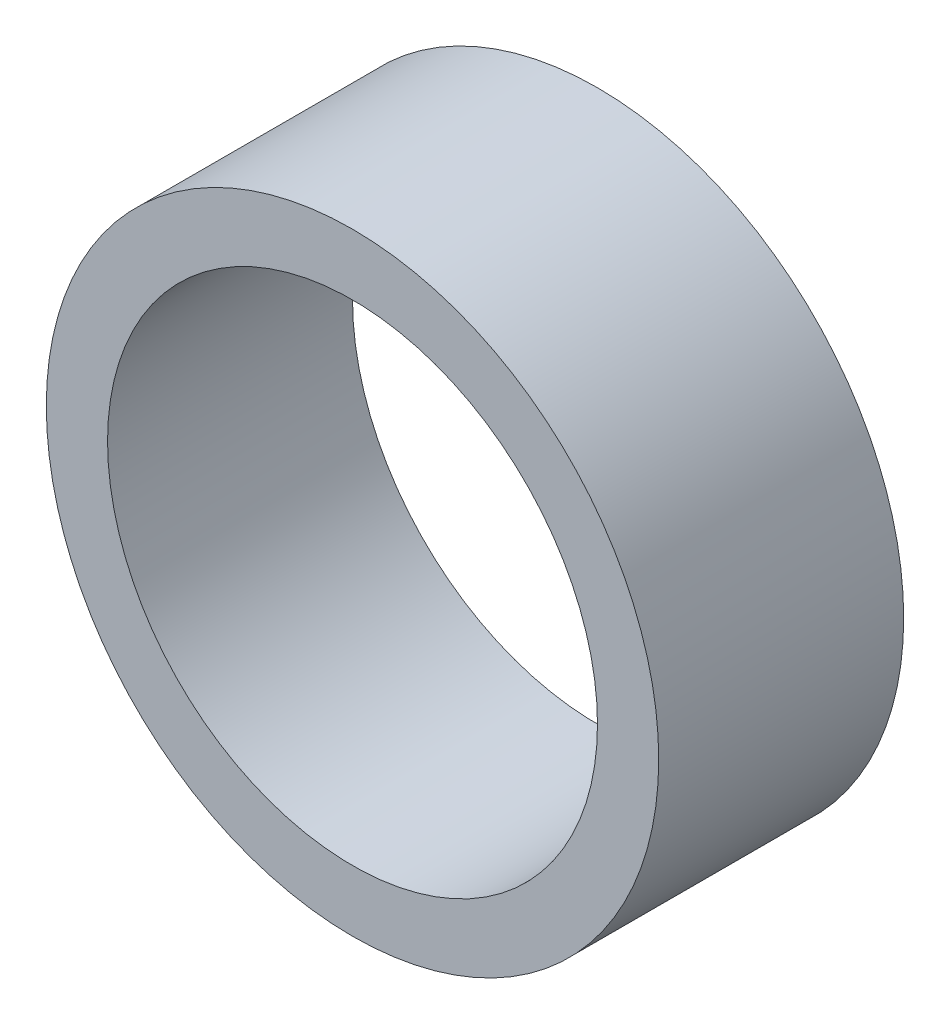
ISO-10303-21;
HEADER;
FILE_DESCRIPTION(('STEP AP214'),'2;1');
FILE_NAME('part.step','',(''),(''),'','','');
FILE_SCHEMA(('AUTOMOTIVE_DESIGN { 1 0 10303 214 1 1 1 1 }'));
ENDSEC;
DATA;
#1=APPLICATION_CONTEXT('core data for automotive mechanical design processes');
#2=APPLICATION_PROTOCOL_DEFINITION('international standard','automotive_design',2000,#1);
#3=PRODUCT_CONTEXT('',#1,'mechanical');
#4=PRODUCT('Part','Part','',(#3));
#5=PRODUCT_RELATED_PRODUCT_CATEGORY('part','',(#4));
#6=PRODUCT_DEFINITION_FORMATION('','',#4);
#7=PRODUCT_DEFINITION_CONTEXT('part definition',#1,'design');
#8=PRODUCT_DEFINITION('design','',#6,#7);
#9=PRODUCT_DEFINITION_SHAPE('','',#8);
#10=(LENGTH_UNIT() NAMED_UNIT(*) SI_UNIT(.MILLI.,.METRE.));
#11=(NAMED_UNIT(*) PLANE_ANGLE_UNIT() SI_UNIT($,.RADIAN.));
#12=(NAMED_UNIT(*) SI_UNIT($,.STERADIAN.) SOLID_ANGLE_UNIT());
#13=UNCERTAINTY_MEASURE_WITH_UNIT(LENGTH_MEASURE(1.E-05),#10,'distance_accuracy_value','');
#14=(GEOMETRIC_REPRESENTATION_CONTEXT(3) GLOBAL_UNCERTAINTY_ASSIGNED_CONTEXT((#13)) GLOBAL_UNIT_ASSIGNED_CONTEXT((#10,
#11,#12)) REPRESENTATION_CONTEXT('',''));
#15=CARTESIAN_POINT('',(0.,0.,0.));
#16=DIRECTION('',(0.,0.,1.));
#17=DIRECTION('',(1.,0.,0.));
#18=AXIS2_PLACEMENT_3D('',#15,#16,#17);
#19=CARTESIAN_POINT('',(0.,0.,-38.9763628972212));
#20=DIRECTION('',(0.,0.,-1.));
#21=DIRECTION('',(-1.,0.,0.));
#22=AXIS2_PLACEMENT_3D('',#19,#20,#21);
#23=CYLINDRICAL_SURFACE('',#22,6.35);
#24=CARTESIAN_POINT('',(0.,0.,6.35));
#25=DIRECTION('',(0.,0.,-1.));
#26=DIRECTION('',(-1.,0.,0.));
#27=AXIS2_PLACEMENT_3D('',#24,#25,#26);
#28=CIRCLE('',#27,6.35);
#29=CARTESIAN_POINT('',(-6.35,0.,6.35));
#30=VERTEX_POINT('',#29);
#31=EDGE_CURVE('E10',#30,#30,#28,.T.);
#32=ORIENTED_EDGE('',*,*,#31,.F.);
#33=EDGE_LOOP('',(#32));
#34=FACE_BOUND('',#33,.T.);
#35=CARTESIAN_POINT('',(0.,0.,0.));
#36=DIRECTION('',(0.,0.,-1.));
#37=DIRECTION('',(-1.,0.,0.));
#38=AXIS2_PLACEMENT_3D('',#35,#36,#37);
#39=CIRCLE('',#38,6.35);
#40=CARTESIAN_POINT('',(-6.35,0.,0.));
#41=VERTEX_POINT('',#40);
#42=EDGE_CURVE('E58',#41,#41,#39,.T.);
#43=ORIENTED_EDGE('',*,*,#42,.T.);
#44=EDGE_LOOP('',(#43));
#45=FACE_BOUND('',#44,.T.);
#46=ADVANCED_FACE('F39',(#34,#45),#23,.F.);
#47=CARTESIAN_POINT('',(-6.34999999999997,0.,6.35));
#48=DIRECTION('',(0.,0.,-1.));
#49=DIRECTION('',(-1.,0.,0.));
#50=AXIS2_PLACEMENT_3D('',#47,#48,#49);
#51=PLANE('',#50);
#52=CARTESIAN_POINT('',(0.,0.,6.35));
#53=DIRECTION('',(0.,0.,-1.));
#54=DIRECTION('',(-1.,0.,0.));
#55=AXIS2_PLACEMENT_3D('',#52,#53,#54);
#56=CIRCLE('',#55,7.9375);
#57=CARTESIAN_POINT('',(-7.9375,0.,6.35));
#58=VERTEX_POINT('',#57);
#59=EDGE_CURVE('E46',#58,#58,#56,.T.);
#60=ORIENTED_EDGE('',*,*,#59,.F.);
#61=EDGE_LOOP('',(#60));
#62=FACE_BOUND('',#61,.T.);
#63=ORIENTED_EDGE('',*,*,#31,.T.);
#64=EDGE_LOOP('',(#63));
#65=FACE_BOUND('',#64,.T.);
#66=ADVANCED_FACE('F75',(#62,#65),#51,.F.);
#67=CARTESIAN_POINT('',(0.,0.,-38.9763628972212));
#68=DIRECTION('',(0.,0.,-1.));
#69=DIRECTION('',(-1.,0.,0.));
#70=AXIS2_PLACEMENT_3D('',#67,#68,#69);
#71=CYLINDRICAL_SURFACE('',#70,7.9375);
#72=CARTESIAN_POINT('',(0.,0.,0.));
#73=DIRECTION('',(0.,0.,-1.));
#74=DIRECTION('',(-1.,0.,0.));
#75=AXIS2_PLACEMENT_3D('',#72,#73,#74);
#76=CIRCLE('',#75,7.9375);
#77=CARTESIAN_POINT('',(-7.9375,0.,0.));
#78=VERTEX_POINT('',#77);
#79=EDGE_CURVE('E52',#78,#78,#76,.T.);
#80=ORIENTED_EDGE('',*,*,#79,.F.);
#81=EDGE_LOOP('',(#80));
#82=FACE_BOUND('',#81,.T.);
#83=ORIENTED_EDGE('',*,*,#59,.T.);
#84=EDGE_LOOP('',(#83));
#85=FACE_BOUND('',#84,.T.);
#86=ADVANCED_FACE('F70',(#82,#85),#71,.T.);
#87=CARTESIAN_POINT('',(-7.93750000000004,0.,0.));
#88=DIRECTION('',(0.,0.,1.));
#89=DIRECTION('',(1.,0.,0.));
#90=AXIS2_PLACEMENT_3D('',#87,#88,#89);
#91=PLANE('',#90);
#92=ORIENTED_EDGE('',*,*,#42,.F.);
#93=EDGE_LOOP('',(#92));
#94=FACE_BOUND('',#93,.T.);
#95=ORIENTED_EDGE('',*,*,#79,.T.);
#96=EDGE_LOOP('',(#95));
#97=FACE_BOUND('',#96,.T.);
#98=ADVANCED_FACE('F67',(#94,#97),#91,.F.);
#99=CLOSED_SHELL('',(#46,#66,#86,#98));
#100=MANIFOLD_SOLID_BREP('B2',#99);
#101=ADVANCED_BREP_SHAPE_REPRESENTATION('',(#18,#100),#14);
#102=SHAPE_DEFINITION_REPRESENTATION(#9,#101);
ENDSEC;
END-ISO-10303-21;
